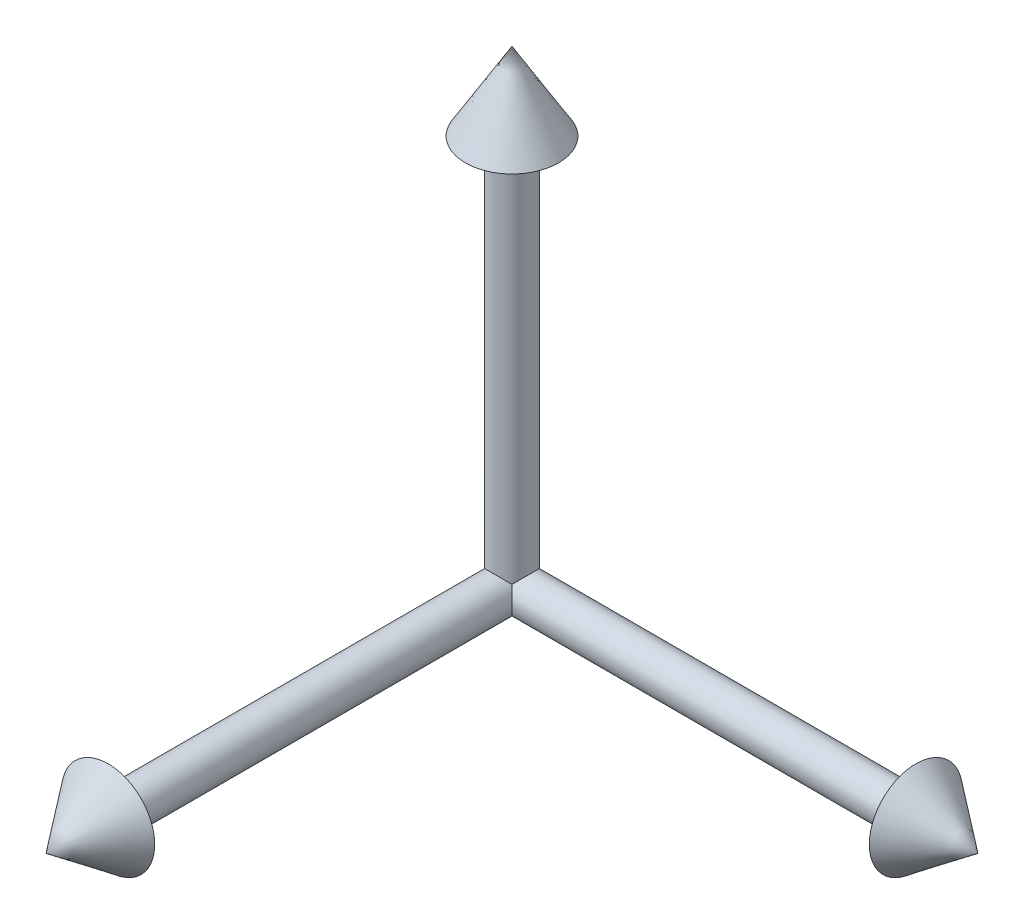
from build123d import *


with BuildPart() as part:
    # Sketch1 → Revolve1 (revolve)
    with BuildSketch(Plane.XY, mode=Mode.PRIVATE) as revolve1_sk:
        Polygon((3.175, 0), (3.175, 63.5), (7.62, 63.5), (0, 76.2), (0, 0), align=None)
    revolve(revolve1_sk.sketch.rotate(Axis((0, 105.261261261, 0), (0, -1, 0)), 90), axis=Axis((0, 105.261261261, 0), (0, -1, 0)))

    # Sketch3 → Revolve2 (revolve)
    with BuildSketch(Plane(origin=(0, 0, 0), x_dir=(0, 0, -1), z_dir=(1, 0, 0)), mode=Mode.PRIVATE) as revolve2_sk:
        Polygon((0, 3.175), (-66.04, 3.175), (-66.04, 7.62), (-76.2, 0), (0, 0), align=None)
    revolve(revolve2_sk.sketch.rotate(Axis((0, 0, 0), (0, 0, 1)), 90), axis=Axis((0, 0, 0), (0, 0, 1)))

    # Sketch4 → Revolve3 (revolve)
    with BuildSketch(Plane.XY, mode=Mode.PRIVATE) as revolve3_sk:
        Polygon((0, 3.175), (66.04, 3.175), (66.04, 7.62), (76.2, 0), (0, 0), align=None)
    revolve(revolve3_sk.sketch.rotate(Axis((0, 0, 0), (1, 0, 0)), 90), axis=Axis((0, 0, 0), (1, 0, 0)))


solid = part.part
